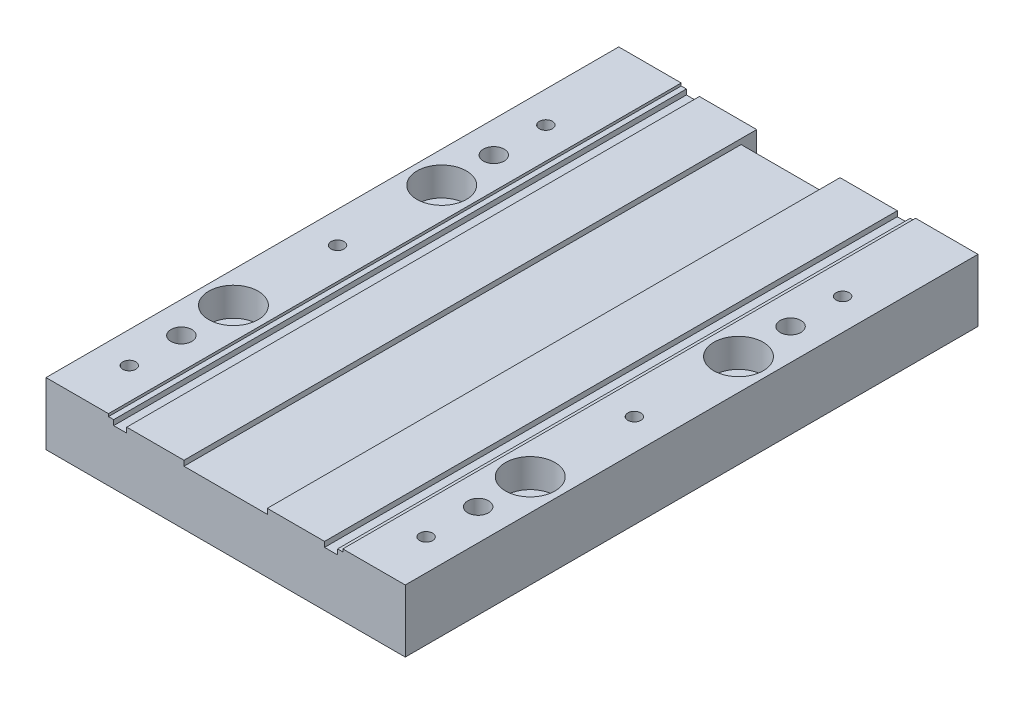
from build123d import *

# Parameters (mm, degrees)
EXTRUDE_1_DEPTH     = 110
SKETCH_2_R          = 1.25
SKETCH_2_R_2        = 2
SKETCH_2_R_3        = 2.75
CUT_EXTRUDE_1_DEPTH = 110
SKETCH_3_R          = 4.75
CUT_EXTRUDE_2_DEPTH = 5.5
CHAMFER_1_SIZE      = 3


with BuildPart() as part:
    # Sketch 1 → Extrude 1 (new body)
    with BuildSketch(Plane.XY):
        Polygon((26.5, 10.5), (42.5, 10.5), (42.5, 11.5), (53.5, 11.5), (53.5, 10.5), (56, 10.5), (56, 11.5), (57, 11.5), (57, 12), (69, 12), (69, 0), (0, 0), (0, 12), (12, 12), (12, 11.5), (13, 11.5), (13, 10.5), (15.5, 10.5), (15.5, 11.5), (26.5, 11.5), align=None)
    extrude(amount=EXTRUDE_1_DEPTH)

    # Sketch 2 → Cut-Extrude 1 (cut)
    with BuildSketch(Plane(origin=(0, 12, 0), x_dir=(1, 0, 0), z_dir=(0, 1, 0))):
        with Locations(Location((6, -20, 0), (0, 0, 270))):
            Circle(SKETCH_2_R)
        with Locations(Location((6, -60, 0), (0, 0, 270))):
            Circle(SKETCH_2_R)
        with Locations(Location((6, -100, 0), (0, 0, 270))):
            Circle(SKETCH_2_R)
        with Locations(Location((63, -100, 0), (0, 0, 270))):
            Circle(SKETCH_2_R)
        with Locations(Location((63, -60, 0), (0, 0, 270))):
            Circle(SKETCH_2_R)
        with Locations(Location((63, -20, 0), (0, 0, 270))):
            Circle(SKETCH_2_R)
        with Locations(Location((6, -30, 0), (0, 0, 270))):
            Circle(SKETCH_2_R_2)
        with Locations(Location((6, -90, 0), (0, 0, 270))):
            Circle(SKETCH_2_R_2)
        with Locations(Location((63, -90, 0), (0, 0, 270))):
            Circle(SKETCH_2_R_2)
        with Locations(Location((63, -30, 0), (0, 0, 270))):
            Circle(SKETCH_2_R_2)
        with Locations(Location((6, -80, 0), (0, 0, 270))):
            Circle(SKETCH_2_R_3)
        with Locations(Location((63, -80, 0), (0, 0, 270))):
            Circle(SKETCH_2_R_3)
        with Locations(Location((63, -40, 0), (0, 0, 270))):
            Circle(SKETCH_2_R_3)
        with Locations(Location((6, -40, 0), (0, 0, 270))):
            Circle(SKETCH_2_R_3)
    extrude(amount=-CUT_EXTRUDE_1_DEPTH, mode=Mode.SUBTRACT)

    # Sketch 3 → Cut-Extrude 2 (cut)
    with BuildSketch(Plane(origin=(0, 12, 0), x_dir=(1, 0, 0), z_dir=(0, 1, 0))):
        with Locations(Location((6, -80, 0), (0, 0, 270))):
            Circle(SKETCH_3_R)
        with Locations(Location((63, -80, 0), (0, 0, 270))):
            Circle(SKETCH_3_R)
        with Locations(Location((63, -40, 0), (0, 0, 270))):
            Circle(SKETCH_3_R)
        with Locations(Location((6, -40, 0), (0, 0, 270))):
            Circle(SKETCH_3_R)
    extrude(amount=-CUT_EXTRUDE_2_DEPTH, mode=Mode.SUBTRACT)

    # Chamfer 1
    chamfer_1_edges = [part.edges().sort_by_distance(p)[0] for p in [
        (34.5, 10.5, 0),
    ]]
    chamfer(chamfer_1_edges, length=CHAMFER_1_SIZE)


solid = part.part
